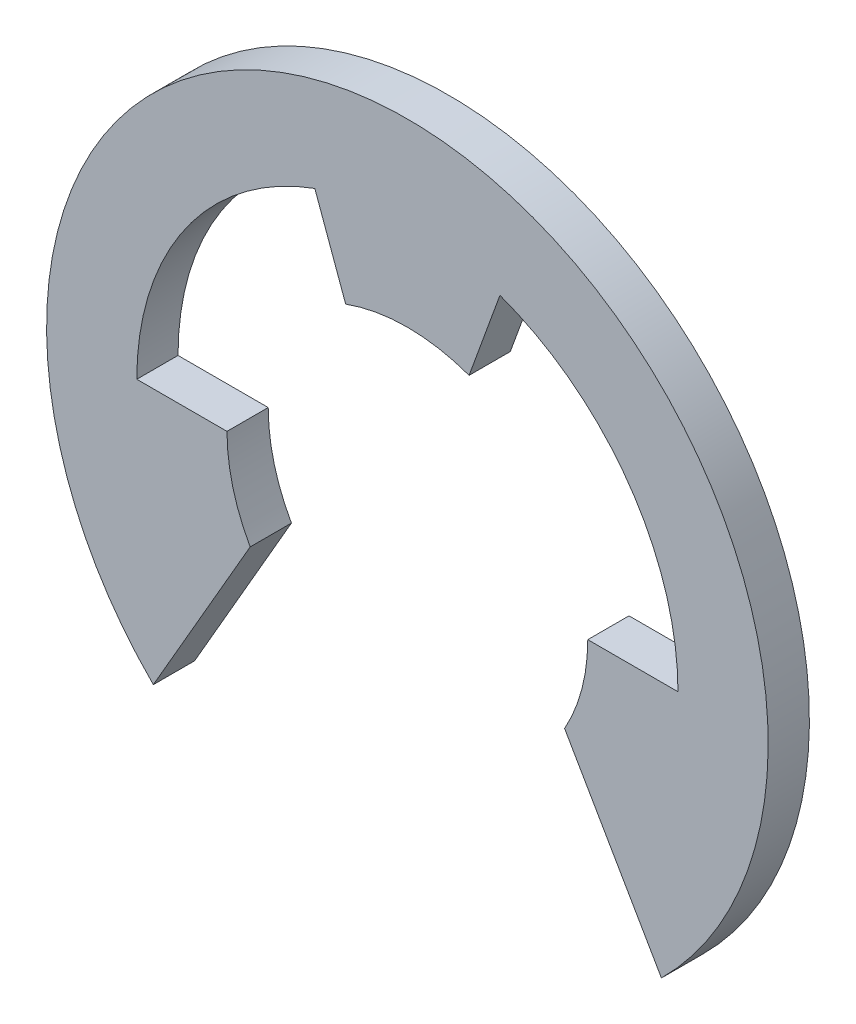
ISO-10303-21;
HEADER;
FILE_DESCRIPTION(('STEP AP214'),'2;1');
FILE_NAME('part.step','',(''),(''),'','','');
FILE_SCHEMA(('AUTOMOTIVE_DESIGN { 1 0 10303 214 1 1 1 1 }'));
ENDSEC;
DATA;
#1=APPLICATION_CONTEXT('core data for automotive mechanical design processes');
#2=APPLICATION_PROTOCOL_DEFINITION('international standard','automotive_design',2000,#1);
#3=PRODUCT_CONTEXT('',#1,'mechanical');
#4=PRODUCT('Part','Part','',(#3));
#5=PRODUCT_RELATED_PRODUCT_CATEGORY('part','',(#4));
#6=PRODUCT_DEFINITION_FORMATION('','',#4);
#7=PRODUCT_DEFINITION_CONTEXT('part definition',#1,'design');
#8=PRODUCT_DEFINITION('design','',#6,#7);
#9=PRODUCT_DEFINITION_SHAPE('','',#8);
#10=(LENGTH_UNIT() NAMED_UNIT(*) SI_UNIT(.MILLI.,.METRE.));
#11=(NAMED_UNIT(*) PLANE_ANGLE_UNIT() SI_UNIT($,.RADIAN.));
#12=(NAMED_UNIT(*) SI_UNIT($,.STERADIAN.) SOLID_ANGLE_UNIT());
#13=UNCERTAINTY_MEASURE_WITH_UNIT(LENGTH_MEASURE(1.E-05),#10,'distance_accuracy_value','');
#14=(GEOMETRIC_REPRESENTATION_CONTEXT(3) GLOBAL_UNCERTAINTY_ASSIGNED_CONTEXT((#13)) GLOBAL_UNIT_ASSIGNED_CONTEXT((#10,
#11,#12)) REPRESENTATION_CONTEXT('',''));
#15=CARTESIAN_POINT('',(0.,0.,0.));
#16=DIRECTION('',(0.,0.,1.));
#17=DIRECTION('',(1.,0.,0.));
#18=AXIS2_PLACEMENT_3D('',#15,#16,#17);
#19=CARTESIAN_POINT('',(0.,1.15774659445,0.8));
#20=DIRECTION('',(0.,0.,1.));
#21=DIRECTION('',(1.,0.,0.));
#22=AXIS2_PLACEMENT_3D('',#19,#20,#21);
#23=PLANE('',#22);
#24=DIRECTION('',(0.50000000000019,-0.866025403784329,0.));
#25=VECTOR('',#24,1.);
#26=CARTESIAN_POINT('',(3.98932677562,-3.34379017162,0.800000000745));
#27=LINE('',#26,#25);
#28=CARTESIAN_POINT('',(4.928653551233,-4.97075187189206,0.800000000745));
#29=VERTEX_POINT('',#28);
#30=CARTESIAN_POINT('',(3.05000000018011,-1.7168284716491,0.800000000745));
#31=VERTEX_POINT('',#30);
#32=EDGE_CURVE('E127',#29,#31,#27,.F.);
#33=ORIENTED_EDGE('',*,*,#32,.F.);
#34=CARTESIAN_POINT('',(0.,0.,0.800000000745));
#35=DIRECTION('',(0.,0.,1.));
#36=DIRECTION('',(1.,0.,0.));
#37=AXIS2_PLACEMENT_3D('',#34,#35,#36);
#38=CIRCLE('',#37,7.);
#39=CARTESIAN_POINT('',(-4.92865355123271,-4.97075187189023,0.800000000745));
#40=VERTEX_POINT('',#39);
#41=EDGE_CURVE('E119',#40,#29,#38,.F.);
#42=ORIENTED_EDGE('',*,*,#41,.F.);
#43=DIRECTION('',(0.50000000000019,0.866025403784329,0.));
#44=VECTOR('',#43,1.);
#45=CARTESIAN_POINT('',(-3.98932677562,-3.34379017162,0.800000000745));
#46=LINE('',#45,#44);
#47=CARTESIAN_POINT('',(-3.05000000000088,-1.71682847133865,0.800000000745));
#48=VERTEX_POINT('',#47);
#49=EDGE_CURVE('E112',#48,#40,#46,.F.);
#50=ORIENTED_EDGE('',*,*,#49,.F.);
#51=CARTESIAN_POINT('',(0.,0.,0.800000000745));
#52=DIRECTION('',(0.,0.,1.));
#53=DIRECTION('',(1.,0.,0.));
#54=AXIS2_PLACEMENT_3D('',#51,#52,#53);
#55=CIRCLE('',#54,3.5);
#56=CARTESIAN_POINT('',(-3.5,0.,0.800000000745));
#57=VERTEX_POINT('',#56);
#58=EDGE_CURVE('E19',#48,#57,#55,.F.);
#59=ORIENTED_EDGE('',*,*,#58,.T.);
#60=DIRECTION('',(-1.,0.,0.));
#61=VECTOR('',#60,1.);
#62=CARTESIAN_POINT('',(-4.375,0.,0.800000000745));
#63=LINE('',#62,#61);
#64=CARTESIAN_POINT('',(-5.25,0.,0.800000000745));
#65=VERTEX_POINT('',#64);
#66=EDGE_CURVE('E109',#65,#57,#63,.F.);
#67=ORIENTED_EDGE('',*,*,#66,.F.);
#68=CARTESIAN_POINT('',(0.,0.,0.800000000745));
#69=DIRECTION('',(0.,0.,1.));
#70=DIRECTION('',(1.,0.,0.));
#71=AXIS2_PLACEMENT_3D('',#68,#69,#70);
#72=CIRCLE('',#71,5.25);
#73=CARTESIAN_POINT('',(-1.79560575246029,4.93338625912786,0.800000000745));
#74=VERTEX_POINT('',#73);
#75=EDGE_CURVE('E142',#65,#74,#72,.F.);
#76=ORIENTED_EDGE('',*,*,#75,.T.);
#77=DIRECTION('',(0.342020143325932,-0.939692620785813,0.));
#78=VECTOR('',#77,1.);
#79=CARTESIAN_POINT('',(-1.49633812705,4.11115521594,0.800000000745));
#80=LINE('',#79,#78);
#81=CARTESIAN_POINT('',(-1.19707050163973,3.28892417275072,0.800000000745));
#82=VERTEX_POINT('',#81);
#83=EDGE_CURVE('E139',#82,#74,#80,.F.);
#84=ORIENTED_EDGE('',*,*,#83,.F.);
#85=CARTESIAN_POINT('',(0.,0.,0.800000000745));
#86=DIRECTION('',(0.,0.,1.));
#87=DIRECTION('',(1.,0.,0.));
#88=AXIS2_PLACEMENT_3D('',#85,#86,#87);
#89=CIRCLE('',#88,3.5);
#90=CARTESIAN_POINT('',(1.19707050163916,3.28892417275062,0.800000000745));
#91=VERTEX_POINT('',#90);
#92=EDGE_CURVE('E138',#82,#91,#89,.F.);
#93=ORIENTED_EDGE('',*,*,#92,.T.);
#94=DIRECTION('',(0.342020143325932,0.939692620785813,0.));
#95=VECTOR('',#94,1.);
#96=CARTESIAN_POINT('',(1.49633812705,4.11115521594,0.800000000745));
#97=LINE('',#96,#95);
#98=CARTESIAN_POINT('',(1.79560575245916,4.93338625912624,0.800000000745));
#99=VERTEX_POINT('',#98);
#100=EDGE_CURVE('E135',#99,#91,#97,.F.);
#101=ORIENTED_EDGE('',*,*,#100,.F.);
#102=CARTESIAN_POINT('',(0.,0.,0.800000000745));
#103=DIRECTION('',(0.,0.,1.));
#104=DIRECTION('',(1.,0.,0.));
#105=AXIS2_PLACEMENT_3D('',#102,#103,#104);
#106=CIRCLE('',#105,5.25);
#107=CARTESIAN_POINT('',(5.25,0.,0.800000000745));
#108=VERTEX_POINT('',#107);
#109=EDGE_CURVE('E134',#99,#108,#106,.F.);
#110=ORIENTED_EDGE('',*,*,#109,.T.);
#111=DIRECTION('',(1.,0.,0.));
#112=VECTOR('',#111,1.);
#113=CARTESIAN_POINT('',(4.375,0.,0.800000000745));
#114=LINE('',#113,#112);
#115=CARTESIAN_POINT('',(3.5,0.,0.800000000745));
#116=VERTEX_POINT('',#115);
#117=EDGE_CURVE('E131',#116,#108,#114,.T.);
#118=ORIENTED_EDGE('',*,*,#117,.F.);
#119=CARTESIAN_POINT('',(0.,0.,0.800000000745));
#120=DIRECTION('',(0.,0.,1.));
#121=DIRECTION('',(1.,0.,0.));
#122=AXIS2_PLACEMENT_3D('',#119,#120,#121);
#123=CIRCLE('',#122,3.5);
#124=EDGE_CURVE('E130',#116,#31,#123,.F.);
#125=ORIENTED_EDGE('',*,*,#124,.T.);
#126=EDGE_LOOP('',(#33,#42,#50,#59,#67,#76,#84,#93,#101,#110,#118,#125));
#127=FACE_BOUND('',#126,.T.);
#128=ADVANCED_FACE('F16',(#127),#23,.T.);
#129=CARTESIAN_POINT('',(0.,0.,0.));
#130=DIRECTION('',(0.,0.,1.));
#131=DIRECTION('',(1.,0.,0.));
#132=AXIS2_PLACEMENT_3D('',#129,#130,#131);
#133=CYLINDRICAL_SURFACE('',#132,3.5);
#134=DIRECTION('',(0.,0.,1.));
#135=VECTOR('',#134,1.);
#136=CARTESIAN_POINT('',(-3.05000000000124,-1.71682847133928,0.));
#137=LINE('',#136,#135);
#138=CARTESIAN_POINT('',(-3.05000000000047,-1.71682847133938,0.));
#139=VERTEX_POINT('',#138);
#140=EDGE_CURVE('E105',#139,#48,#137,.T.);
#141=ORIENTED_EDGE('',*,*,#140,.F.);
#142=CARTESIAN_POINT('',(0.,0.,0.));
#143=DIRECTION('',(0.,0.,1.));
#144=DIRECTION('',(1.,0.,0.));
#145=AXIS2_PLACEMENT_3D('',#142,#143,#144);
#146=CIRCLE('',#145,3.5);
#147=CARTESIAN_POINT('',(-3.5,0.,0.));
#148=VERTEX_POINT('',#147);
#149=EDGE_CURVE('E115',#139,#148,#146,.F.);
#150=ORIENTED_EDGE('',*,*,#149,.T.);
#151=DIRECTION('',(0.,0.,1.));
#152=VECTOR('',#151,1.);
#153=CARTESIAN_POINT('',(-3.5,0.,0.));
#154=LINE('',#153,#152);
#155=EDGE_CURVE('E106',#57,#148,#154,.F.);
#156=ORIENTED_EDGE('',*,*,#155,.F.);
#157=ORIENTED_EDGE('',*,*,#58,.F.);
#158=EDGE_LOOP('',(#141,#150,#156,#157));
#159=FACE_BOUND('',#158,.T.);
#160=ADVANCED_FACE('F103',(#159),#133,.F.);
#161=CARTESIAN_POINT('',(-4.375,0.,0.));
#162=DIRECTION('',(0.,1.,0.));
#163=DIRECTION('',(-1.,0.,0.));
#164=AXIS2_PLACEMENT_3D('',#161,#162,#163);
#165=PLANE('',#164);
#166=DIRECTION('',(1.,0.,0.));
#167=VECTOR('',#166,1.);
#168=CARTESIAN_POINT('',(0.,0.,0.));
#169=LINE('',#168,#167);
#170=CARTESIAN_POINT('',(-5.25,0.,0.));
#171=VERTEX_POINT('',#170);
#172=EDGE_CURVE('E162',#148,#171,#169,.F.);
#173=ORIENTED_EDGE('',*,*,#172,.T.);
#174=DIRECTION('',(0.,0.,1.));
#175=VECTOR('',#174,1.);
#176=CARTESIAN_POINT('',(-5.25,0.,0.));
#177=LINE('',#176,#175);
#178=EDGE_CURVE('E173',#171,#65,#177,.T.);
#179=ORIENTED_EDGE('',*,*,#178,.T.);
#180=ORIENTED_EDGE('',*,*,#66,.T.);
#181=ORIENTED_EDGE('',*,*,#155,.T.);
#182=EDGE_LOOP('',(#173,#179,#180,#181));
#183=FACE_BOUND('',#182,.T.);
#184=ADVANCED_FACE('F234',(#183),#165,.T.);
#185=CARTESIAN_POINT('',(0.,0.,0.));
#186=DIRECTION('',(0.,0.,1.));
#187=DIRECTION('',(1.,0.,0.));
#188=AXIS2_PLACEMENT_3D('',#185,#186,#187);
#189=CYLINDRICAL_SURFACE('',#188,5.25);
#190=ORIENTED_EDGE('',*,*,#178,.F.);
#191=CARTESIAN_POINT('',(0.,0.,0.));
#192=DIRECTION('',(0.,0.,1.));
#193=DIRECTION('',(1.,0.,0.));
#194=AXIS2_PLACEMENT_3D('',#191,#192,#193);
#195=CIRCLE('',#194,5.25);
#196=CARTESIAN_POINT('',(-1.79560575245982,4.93338625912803,0.));
#197=VERTEX_POINT('',#196);
#198=EDGE_CURVE('E159',#171,#197,#195,.F.);
#199=ORIENTED_EDGE('',*,*,#198,.T.);
#200=DIRECTION('',(0.,0.,1.));
#201=VECTOR('',#200,1.);
#202=CARTESIAN_POINT('',(-1.79560575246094,4.93338625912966,0.));
#203=LINE('',#202,#201);
#204=EDGE_CURVE('E141',#74,#197,#203,.F.);
#205=ORIENTED_EDGE('',*,*,#204,.F.);
#206=ORIENTED_EDGE('',*,*,#75,.F.);
#207=EDGE_LOOP('',(#190,#199,#205,#206));
#208=FACE_BOUND('',#207,.T.);
#209=ADVANCED_FACE('F232',(#208),#189,.F.);
#210=CARTESIAN_POINT('',(-1.49633812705,4.11115521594,0.));
#211=DIRECTION('',(-0.939692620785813,-0.342020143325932,0.));
#212=DIRECTION('',(0.342020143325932,-0.939692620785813,0.));
#213=AXIS2_PLACEMENT_3D('',#210,#211,#212);
#214=PLANE('',#213);
#215=DIRECTION('',(0.342020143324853,-0.939692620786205,0.));
#216=VECTOR('',#215,1.);
#217=CARTESIAN_POINT('',(-1.79560575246,4.93338625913,0.));
#218=LINE('',#217,#216);
#219=CARTESIAN_POINT('',(-1.1970705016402,3.28892417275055,0.));
#220=VERTEX_POINT('',#219);
#221=EDGE_CURVE('E158',#197,#220,#218,.T.);
#222=ORIENTED_EDGE('',*,*,#221,.T.);
#223=DIRECTION('',(0.,0.,1.));
#224=VECTOR('',#223,1.);
#225=CARTESIAN_POINT('',(-1.1970705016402,3.28892417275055,0.));
#226=LINE('',#225,#224);
#227=EDGE_CURVE('E171',#220,#82,#226,.T.);
#228=ORIENTED_EDGE('',*,*,#227,.T.);
#229=ORIENTED_EDGE('',*,*,#83,.T.);
#230=ORIENTED_EDGE('',*,*,#204,.T.);
#231=EDGE_LOOP('',(#222,#228,#229,#230));
#232=FACE_BOUND('',#231,.T.);
#233=ADVANCED_FACE('F228',(#232),#214,.T.);
#234=CARTESIAN_POINT('',(0.,0.,0.));
#235=DIRECTION('',(0.,0.,1.));
#236=DIRECTION('',(1.,0.,0.));
#237=AXIS2_PLACEMENT_3D('',#234,#235,#236);
#238=CYLINDRICAL_SURFACE('',#237,3.5);
#239=ORIENTED_EDGE('',*,*,#227,.F.);
#240=CARTESIAN_POINT('',(0.,0.,0.));
#241=DIRECTION('',(0.,0.,1.));
#242=DIRECTION('',(1.,0.,0.));
#243=AXIS2_PLACEMENT_3D('',#240,#241,#242);
#244=CIRCLE('',#243,3.5);
#245=CARTESIAN_POINT('',(1.19707050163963,3.28892417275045,0.));
#246=VERTEX_POINT('',#245);
#247=EDGE_CURVE('E155',#220,#246,#244,.F.);
#248=ORIENTED_EDGE('',*,*,#247,.T.);
#249=DIRECTION('',(0.,0.,1.));
#250=VECTOR('',#249,1.);
#251=CARTESIAN_POINT('',(1.19707050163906,3.28892417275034,0.));
#252=LINE('',#251,#250);
#253=EDGE_CURVE('E137',#91,#246,#252,.F.);
#254=ORIENTED_EDGE('',*,*,#253,.F.);
#255=ORIENTED_EDGE('',*,*,#92,.F.);
#256=EDGE_LOOP('',(#239,#248,#254,#255));
#257=FACE_BOUND('',#256,.T.);
#258=ADVANCED_FACE('F225',(#257),#238,.F.);
#259=CARTESIAN_POINT('',(1.49633812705,4.11115521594,0.));
#260=DIRECTION('',(0.939692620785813,-0.342020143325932,0.));
#261=DIRECTION('',(0.342020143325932,0.939692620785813,0.));
#262=AXIS2_PLACEMENT_3D('',#259,#260,#261);
#263=PLANE('',#262);
#264=DIRECTION('',(0.342020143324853,0.939692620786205,0.));
#265=VECTOR('',#264,1.);
#266=CARTESIAN_POINT('',(1.19707050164,3.28892417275,0.));
#267=LINE('',#266,#265);
#268=CARTESIAN_POINT('',(1.79560575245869,4.93338625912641,0.));
#269=VERTEX_POINT('',#268);
#270=EDGE_CURVE('E154',#246,#269,#267,.T.);
#271=ORIENTED_EDGE('',*,*,#270,.T.);
#272=DIRECTION('',(0.,0.,1.));
#273=VECTOR('',#272,1.);
#274=CARTESIAN_POINT('',(1.79560575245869,4.93338625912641,0.));
#275=LINE('',#274,#273);
#276=EDGE_CURVE('E169',#269,#99,#275,.T.);
#277=ORIENTED_EDGE('',*,*,#276,.T.);
#278=ORIENTED_EDGE('',*,*,#100,.T.);
#279=ORIENTED_EDGE('',*,*,#253,.T.);
#280=EDGE_LOOP('',(#271,#277,#278,#279));
#281=FACE_BOUND('',#280,.T.);
#282=ADVANCED_FACE('F220',(#281),#263,.T.);
#283=CARTESIAN_POINT('',(0.,0.,0.));
#284=DIRECTION('',(0.,0.,1.));
#285=DIRECTION('',(1.,0.,0.));
#286=AXIS2_PLACEMENT_3D('',#283,#284,#285);
#287=CYLINDRICAL_SURFACE('',#286,5.25);
#288=ORIENTED_EDGE('',*,*,#276,.F.);
#289=CARTESIAN_POINT('',(0.,0.,0.));
#290=DIRECTION('',(0.,0.,1.));
#291=DIRECTION('',(1.,0.,0.));
#292=AXIS2_PLACEMENT_3D('',#289,#290,#291);
#293=CIRCLE('',#292,5.25);
#294=CARTESIAN_POINT('',(5.25,0.,0.));
#295=VERTEX_POINT('',#294);
#296=EDGE_CURVE('E151',#269,#295,#293,.F.);
#297=ORIENTED_EDGE('',*,*,#296,.T.);
#298=DIRECTION('',(0.,0.,1.));
#299=VECTOR('',#298,1.);
#300=CARTESIAN_POINT('',(5.25,0.,0.));
#301=LINE('',#300,#299);
#302=EDGE_CURVE('E133',#108,#295,#301,.F.);
#303=ORIENTED_EDGE('',*,*,#302,.F.);
#304=ORIENTED_EDGE('',*,*,#109,.F.);
#305=EDGE_LOOP('',(#288,#297,#303,#304));
#306=FACE_BOUND('',#305,.T.);
#307=ADVANCED_FACE('F217',(#306),#287,.F.);
#308=CARTESIAN_POINT('',(4.375,0.,0.));
#309=DIRECTION('',(0.,1.,0.));
#310=DIRECTION('',(0.,0.,1.));
#311=AXIS2_PLACEMENT_3D('',#308,#309,#310);
#312=PLANE('',#311);
#313=DIRECTION('',(1.,0.,0.));
#314=VECTOR('',#313,1.);
#315=CARTESIAN_POINT('',(0.,0.,0.));
#316=LINE('',#315,#314);
#317=CARTESIAN_POINT('',(3.5,0.,0.));
#318=VERTEX_POINT('',#317);
#319=EDGE_CURVE('E150',#295,#318,#316,.F.);
#320=ORIENTED_EDGE('',*,*,#319,.T.);
#321=DIRECTION('',(0.,0.,1.));
#322=VECTOR('',#321,1.);
#323=CARTESIAN_POINT('',(3.5,0.,0.));
#324=LINE('',#323,#322);
#325=EDGE_CURVE('E166',#318,#116,#324,.T.);
#326=ORIENTED_EDGE('',*,*,#325,.T.);
#327=ORIENTED_EDGE('',*,*,#117,.T.);
#328=ORIENTED_EDGE('',*,*,#302,.T.);
#329=EDGE_LOOP('',(#320,#326,#327,#328));
#330=FACE_BOUND('',#329,.T.);
#331=ADVANCED_FACE('F212',(#330),#312,.T.);
#332=CARTESIAN_POINT('',(0.,0.,0.));
#333=DIRECTION('',(0.,0.,1.));
#334=DIRECTION('',(1.,0.,0.));
#335=AXIS2_PLACEMENT_3D('',#332,#333,#334);
#336=CYLINDRICAL_SURFACE('',#335,3.5);
#337=ORIENTED_EDGE('',*,*,#325,.F.);
#338=CARTESIAN_POINT('',(0.,0.,0.));
#339=DIRECTION('',(0.,0.,1.));
#340=DIRECTION('',(1.,0.,0.));
#341=AXIS2_PLACEMENT_3D('',#338,#339,#340);
#342=CIRCLE('',#341,3.5);
#343=CARTESIAN_POINT('',(3.05000000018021,-1.71682847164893,0.));
#344=VERTEX_POINT('',#343);
#345=EDGE_CURVE('E147',#318,#344,#342,.F.);
#346=ORIENTED_EDGE('',*,*,#345,.T.);
#347=DIRECTION('',(0.,0.,1.));
#348=VECTOR('',#347,1.);
#349=CARTESIAN_POINT('',(3.05000000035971,-1.71682847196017,0.));
#350=LINE('',#349,#348);
#351=EDGE_CURVE('E129',#31,#344,#350,.F.);
#352=ORIENTED_EDGE('',*,*,#351,.F.);
#353=ORIENTED_EDGE('',*,*,#124,.F.);
#354=EDGE_LOOP('',(#337,#346,#352,#353));
#355=FACE_BOUND('',#354,.T.);
#356=ADVANCED_FACE('F209',(#355),#336,.F.);
#357=CARTESIAN_POINT('',(3.98932677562,-3.34379017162,0.));
#358=DIRECTION('',(-0.866025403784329,-0.50000000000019,0.));
#359=DIRECTION('',(0.50000000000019,-0.866025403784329,0.));
#360=AXIS2_PLACEMENT_3D('',#357,#358,#359);
#361=PLANE('',#360);
#362=DIRECTION('',(0.499999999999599,-0.86602540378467,0.));
#363=VECTOR('',#362,1.);
#364=CARTESIAN_POINT('',(3.05000000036,-1.71682847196,0.));
#365=LINE('',#364,#363);
#366=CARTESIAN_POINT('',(4.92865355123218,-4.97075187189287,0.));
#367=VERTEX_POINT('',#366);
#368=EDGE_CURVE('E146',#344,#367,#365,.T.);
#369=ORIENTED_EDGE('',*,*,#368,.T.);
#370=DIRECTION('',(0.,0.,1.));
#371=VECTOR('',#370,1.);
#372=CARTESIAN_POINT('',(4.92865355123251,-4.97075187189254,0.));
#373=LINE('',#372,#371);
#374=EDGE_CURVE('E122',#29,#367,#373,.F.);
#375=ORIENTED_EDGE('',*,*,#374,.F.);
#376=ORIENTED_EDGE('',*,*,#32,.T.);
#377=ORIENTED_EDGE('',*,*,#351,.T.);
#378=EDGE_LOOP('',(#369,#375,#376,#377));
#379=FACE_BOUND('',#378,.T.);
#380=ADVANCED_FACE('F202',(#379),#361,.T.);
#381=CARTESIAN_POINT('',(0.,0.,0.));
#382=DIRECTION('',(0.,0.,1.));
#383=DIRECTION('',(1.,0.,0.));
#384=AXIS2_PLACEMENT_3D('',#381,#382,#383);
#385=CYLINDRICAL_SURFACE('',#384,7.);
#386=DIRECTION('',(0.,0.,1.));
#387=VECTOR('',#386,1.);
#388=CARTESIAN_POINT('',(-4.92865355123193,-4.97075187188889,0.));
#389=LINE('',#388,#387);
#390=CARTESIAN_POINT('',(-4.92865355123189,-4.97075187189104,0.));
#391=VERTEX_POINT('',#390);
#392=EDGE_CURVE('E116',#40,#391,#389,.F.);
#393=ORIENTED_EDGE('',*,*,#392,.F.);
#394=ORIENTED_EDGE('',*,*,#41,.T.);
#395=ORIENTED_EDGE('',*,*,#374,.T.);
#396=CARTESIAN_POINT('',(0.,0.,0.));
#397=DIRECTION('',(0.,0.,1.));
#398=DIRECTION('',(1.,0.,0.));
#399=AXIS2_PLACEMENT_3D('',#396,#397,#398);
#400=CIRCLE('',#399,7.);
#401=EDGE_CURVE('E25',#367,#391,#400,.T.);
#402=ORIENTED_EDGE('',*,*,#401,.T.);
#403=EDGE_LOOP('',(#393,#394,#395,#402));
#404=FACE_BOUND('',#403,.T.);
#405=ADVANCED_FACE('F248',(#404),#385,.T.);
#406=CARTESIAN_POINT('',(-3.98932677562,-3.34379017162,0.));
#407=DIRECTION('',(0.866025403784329,-0.50000000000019,0.));
#408=DIRECTION('',(0.50000000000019,0.866025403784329,0.));
#409=AXIS2_PLACEMENT_3D('',#406,#407,#408);
#410=PLANE('',#409);
#411=DIRECTION('',(0.500000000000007,0.866025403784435,0.));
#412=VECTOR('',#411,1.);
#413=CARTESIAN_POINT('',(-4.92865355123,-4.97075187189,0.));
#414=LINE('',#413,#412);
#415=EDGE_CURVE('E11',#391,#139,#414,.T.);
#416=ORIENTED_EDGE('',*,*,#415,.T.);
#417=ORIENTED_EDGE('',*,*,#140,.T.);
#418=ORIENTED_EDGE('',*,*,#49,.T.);
#419=ORIENTED_EDGE('',*,*,#392,.T.);
#420=EDGE_LOOP('',(#416,#417,#418,#419));
#421=FACE_BOUND('',#420,.T.);
#422=ADVANCED_FACE('F111',(#421),#410,.T.);
#423=CARTESIAN_POINT('',(0.,1.15774659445,0.));
#424=DIRECTION('',(0.,0.,1.));
#425=DIRECTION('',(1.,0.,0.));
#426=AXIS2_PLACEMENT_3D('',#423,#424,#425);
#427=PLANE('',#426);
#428=ORIENTED_EDGE('',*,*,#415,.F.);
#429=ORIENTED_EDGE('',*,*,#401,.F.);
#430=ORIENTED_EDGE('',*,*,#368,.F.);
#431=ORIENTED_EDGE('',*,*,#345,.F.);
#432=ORIENTED_EDGE('',*,*,#319,.F.);
#433=ORIENTED_EDGE('',*,*,#296,.F.);
#434=ORIENTED_EDGE('',*,*,#270,.F.);
#435=ORIENTED_EDGE('',*,*,#247,.F.);
#436=ORIENTED_EDGE('',*,*,#221,.F.);
#437=ORIENTED_EDGE('',*,*,#198,.F.);
#438=ORIENTED_EDGE('',*,*,#172,.F.);
#439=ORIENTED_EDGE('',*,*,#149,.F.);
#440=EDGE_LOOP('',(#428,#429,#430,#431,#432,#433,#434,#435,#436,#437,#438,#439));
#441=FACE_BOUND('',#440,.T.);
#442=ADVANCED_FACE('F206',(#441),#427,.F.);
#443=CLOSED_SHELL('',(#128,#160,#184,#209,#233,#258,#282,#307,#331,#356,#380,#405,#422,#442));
#444=MANIFOLD_SOLID_BREP('B1',#443);
#445=ADVANCED_BREP_SHAPE_REPRESENTATION('',(#18,#444),#14);
#446=SHAPE_DEFINITION_REPRESENTATION(#9,#445);
ENDSEC;
END-ISO-10303-21;
